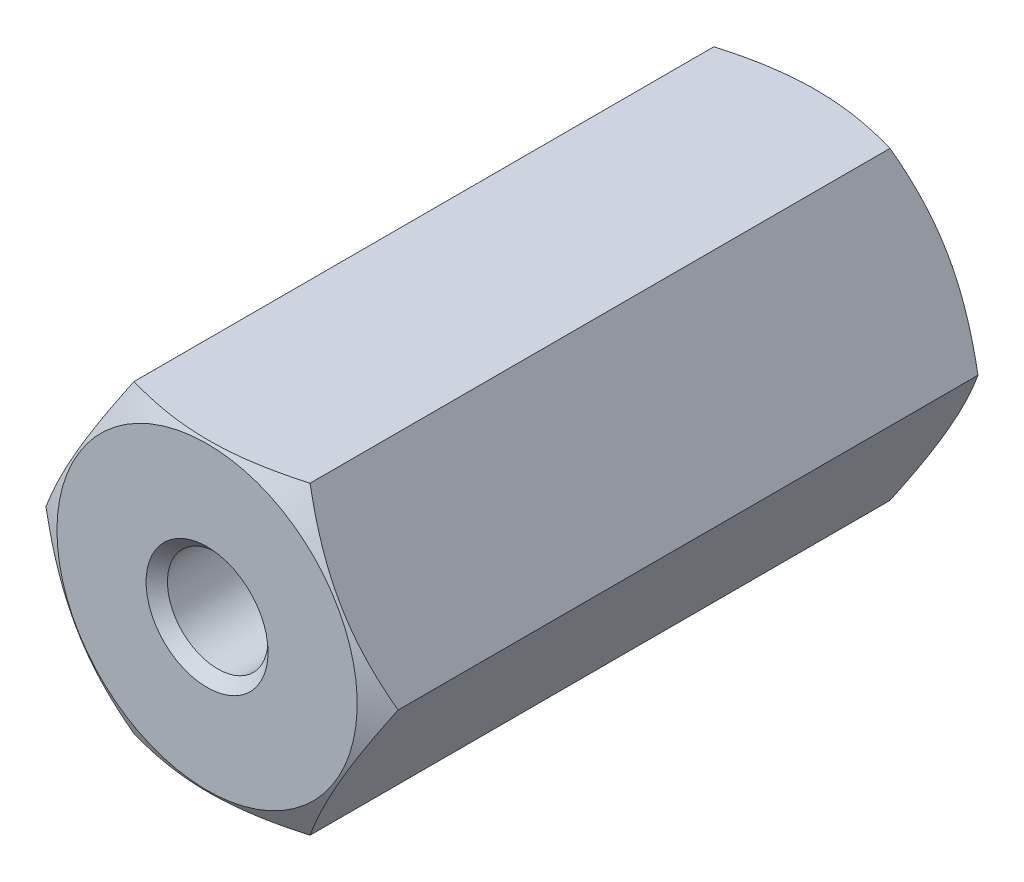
from build123d import *

# Parameters (mm, degrees)
BASE_EXTRUSION_DEPTH = 20
PER_AGE1_D           = 3.3
PER_AGE1_DEPTH       = 10
PER_AGE1_TIP         = 0.991420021
CHANFREIN1_SIZE      = 0.35


with BuildPart() as part:
    # Esquisse26 → Base-Extrusion (new body)
    with BuildSketch(Plane.XY):
        Polygon((-2.886751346, 5), (2.886751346, 5), (5.773502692, 0), (2.886751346, -5), (-2.886751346, -5), (-5.773502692, 0), align=None)
    extrude(amount=-BASE_EXTRUSION_DEPTH)

    # Per_age1
    with Locations(Plane.XY):
        with Locations((0, 0)):
            Hole(PER_AGE1_D / 2, depth=PER_AGE1_DEPTH)
            with Locations((0, 0, -(PER_AGE1_DEPTH + PER_AGE1_TIP / 2))):  # 118° drill point
                Cone(0, PER_AGE1_D / 2, PER_AGE1_TIP, mode=Mode.SUBTRACT)

    # Chanfrein1
    chanfrein1_edges = [part.edges().sort_by_distance(p)[0] for p in [
        (1.65, 0, 0),
    ]]
    chamfer(chanfrein1_edges, length=CHANFREIN1_SIZE)

    # Couper-Balayage4: sweep along a path in Esquisse38
    with BuildLine(Plane.XY) as couper_balayage4_path:
        CenterArc((0, 0), 3.5, 0, 360)
    # Esquisse37 → Couper-Balayage4 (sweep, cut)
    with BuildSketch(Plane(origin=(0, 0, 0), x_dir=(1, 0, 0), z_dir=(0, 1, 0))):
        Polygon((-5.773502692, 0), (-5.773502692, 0.490747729), (-4.923502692, 0), align=None)
    sweep(path=couper_balayage4_path.line, mode=Mode.SUBTRACT)

    # Couper-Balayage5: sweep along a path in Esquisse40
    with BuildLine(Plane(origin=(0, 0, -20), x_dir=(-1, 0, 0), z_dir=(0, 0, -1))) as couper_balayage5_path:
        CenterArc((0, 0), 3.5, 0, 360)
    # Esquisse39 → Couper-Balayage5 (sweep, cut)
    with BuildSketch(Plane(origin=(0, 0, 0), x_dir=(1, 0, 0), z_dir=(0, 1, 0))):
        Polygon((-5.773502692, 20), (-4.923502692, 20), (-5.773502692, 19.509252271), align=None)
    sweep(path=couper_balayage5_path.line, mode=Mode.SUBTRACT)


solid = part.part
